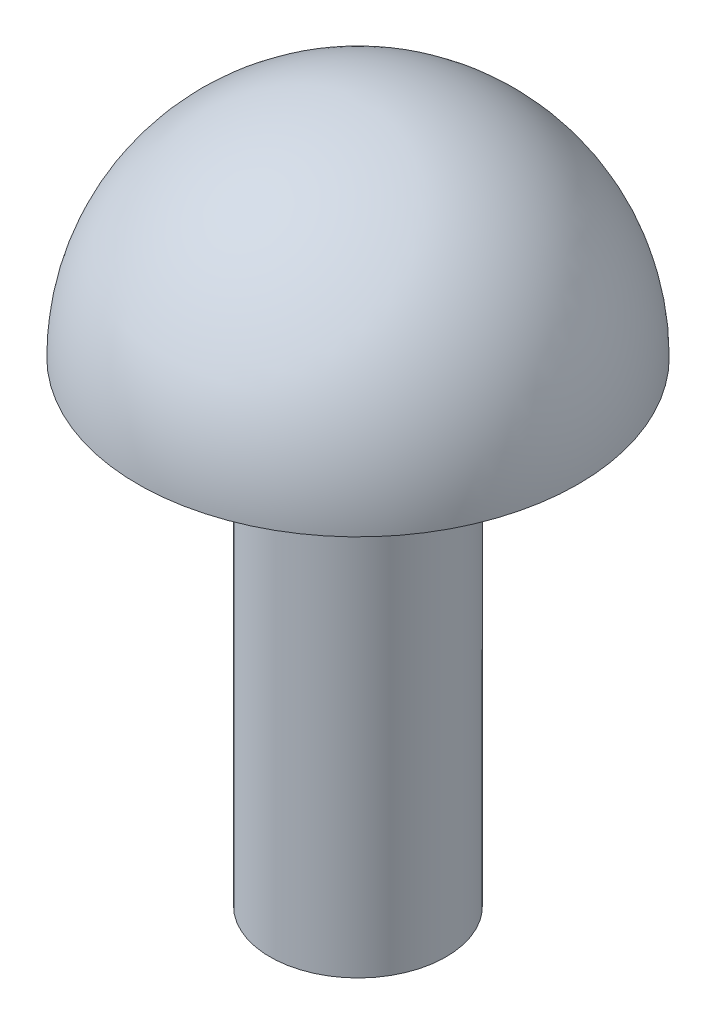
from build123d import *


with BuildPart() as part:
    # Sketch1 → Revolve1 (revolve)
    with BuildSketch(Plane.XY, mode=Mode.PRIVATE) as revolve1_sk:
        with BuildLine():
            Line((0, 7.9), (0, 5.4))
            Line((0, 5.4), (0, 5))
            Line((0, 5), (0, 0))
            Line((0, 0), (1, 0))
            Line((1, 0), (1, 5))
            Line((1, 5), (2.5, 5.4))
            ThreePointArc((2.5, 5.4), (1.767766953, 7.167766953), (0, 7.9))
        make_face()
    revolve(revolve1_sk.sketch.rotate(Axis((0, 0, 0), (0, 1, 0)), 90), axis=Axis((0, 0, 0), (0, 1, 0)))


solid = part.part
